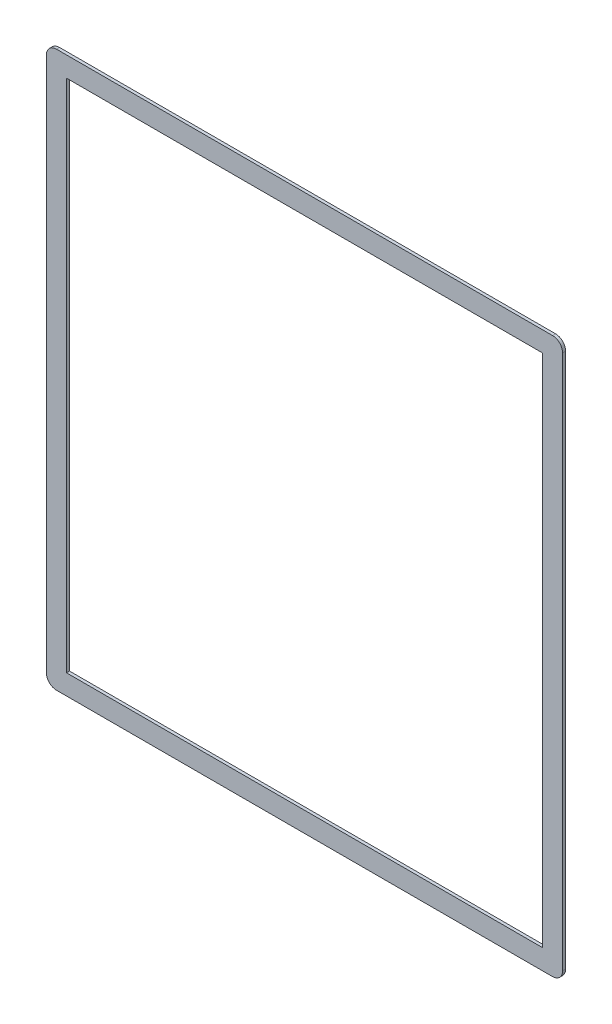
from build123d import *

# Parameters (mm, degrees)
BOSS_EXTRUDE1_DEPTH = 1.905
SHELL1_T            = -12.7


with BuildPart() as part:
    # Sketch1 → Boss-Extrude1 (new body)
    with BuildSketch(Plane.XY):
        with BuildLine():
            Line((-169.92003865, 163.574091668), (-169.92003865, -174.499908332))
            ThreePointArc((-169.92003865, -174.499908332), (-168.060166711, -178.990036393), (-163.57003865, -180.849908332))
            Line((-163.57003865, -180.849908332), (149.86596135, -180.849908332))
            ThreePointArc((149.86596135, -180.849908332), (154.35608941, -178.990036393), (156.21596135, -174.499908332))
            Line((156.21596135, -174.499908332), (156.21596135, 163.574091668))
            ThreePointArc((156.21596135, 163.574091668), (154.35608941, 168.064219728), (149.86596135, 169.924091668))
            Line((149.86596135, 169.924091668), (-163.57003865, 169.924091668))
            ThreePointArc((-163.57003865, 169.924091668), (-168.060166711, 168.064219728), (-169.92003865, 163.574091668))
        make_face()
    extrude(amount=BOSS_EXTRUDE1_DEPTH)

    # Shell1
    shell1_openings = [part.faces().sort_by_distance(p)[0] for p in [
        (-6.85203865, -5.462908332, 1.905),
        (-6.85203865, -5.462908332, 0),
    ]]
    offset(amount=SHELL1_T, openings=shell1_openings, kind=Kind.INTERSECTION)


solid = part.part
